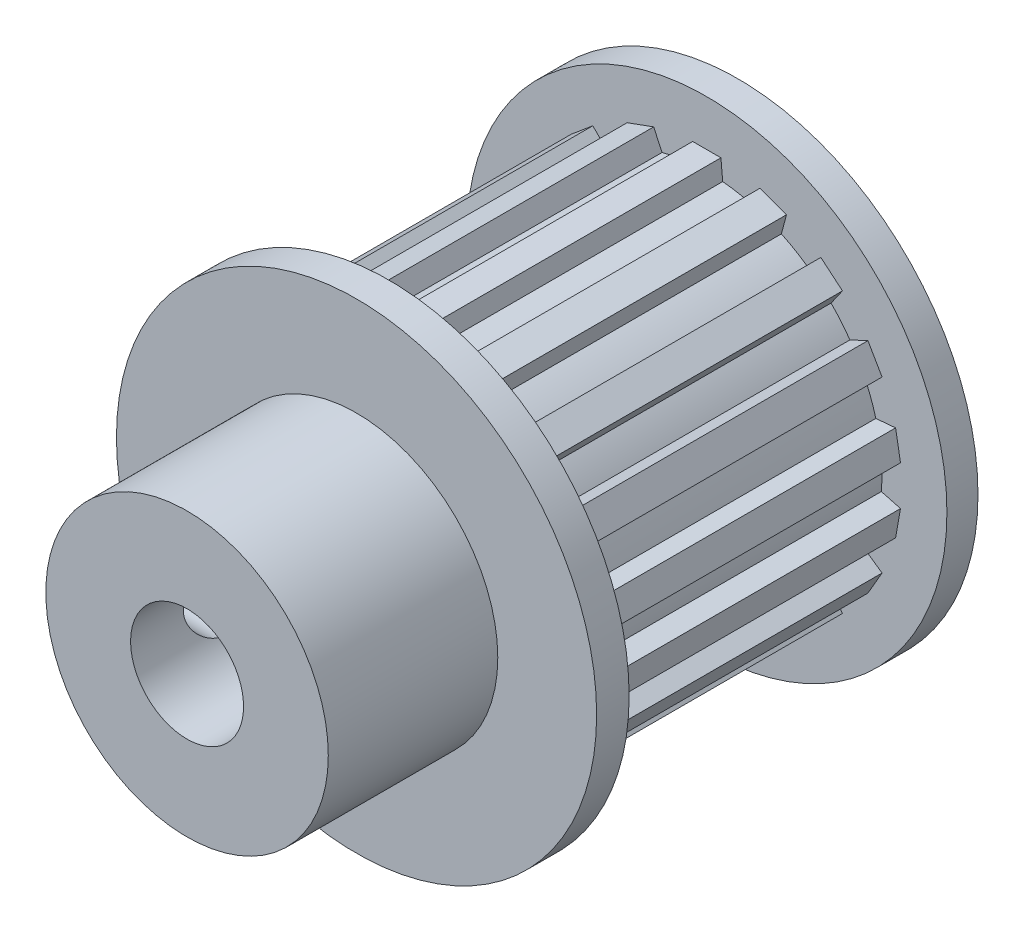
from build123d import *

# Parameters (mm, degrees)
SKETCH6_R                 = 2
CUT_EXTRUDE2_DEPTH        = 24.334523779
SKETCH11_OUTSIDE_W        = 25.254
SKETCH11_OUTSIDE_H        = 25.254
SKETCH11_OUTSIDE_R        = 5
CUT_EXTRUDE3_DEPTH        = 6
F_4_40_TAPPED_HOLE1_D     = 2.2606
F_4_40_TAPPED_HOLE1_DEPTH = 8.5
SKETCH12_OUTSIDE_W        = 25.254
SKETCH12_OUTSIDE_H        = 25.254
SKETCH12_OUTSIDE_R        = 5
CUT_EXTRUDE4_DEPTH        = 0.5
EXTRUDE1_DEPTH            = 11.25
CIRPATTERN1_COUNT         = 18


with BuildPart() as part:
    # Sketch2 → Revolve1 (revolve)
    with BuildSketch(Plane(origin=(0, 0, 0), x_dir=(1, 0, 0), z_dir=(0, 1, 0))):
        Polygon((0, 0), (0, 20), (8.5, 20), (8.5, 18.4), (6.2, 18.4), (6.2, 7.15), (8.5, 7.15), (8.5, 0), align=None)
    revolve(axis=Axis((0, 0, 0), (0, 0, -1)))

    # Sketch6 → Cut-Extrude2 (cut, through all)
    with BuildSketch(Plane(origin=(0, 0, -20), x_dir=(-1, 0, 0), z_dir=(0, 0, -1))):
        Circle(SKETCH6_R)
    extrude(amount=-CUT_EXTRUDE2_DEPTH, mode=Mode.SUBTRACT)

    # Sketch11 outside → Cut-Extrude3 (cut)
    with BuildSketch(Plane.XY):
        Rectangle(SKETCH11_OUTSIDE_W, SKETCH11_OUTSIDE_H)
        Circle(SKETCH11_OUTSIDE_R, mode=Mode.SUBTRACT)
    extrude(amount=-CUT_EXTRUDE3_DEPTH, mode=Mode.SUBTRACT)

    # 4-40 Tapped Hole1
    with Locations(Plane(origin=(-8.5, 0, -3), x_dir=(0, -1, 0), z_dir=(-1, 0, 0))):
        with Locations((0, 0)):
            Hole(F_4_40_TAPPED_HOLE1_D / 2, depth=F_4_40_TAPPED_HOLE1_DEPTH)

    # Sketch12 outside → Cut-Extrude4 (cut)
    with BuildSketch(Plane(origin=(0, 0, -20), x_dir=(-1, 0, 0), z_dir=(0, 0, -1))):
        Rectangle(SKETCH12_OUTSIDE_W, SKETCH12_OUTSIDE_H)
        with Locations(Location((0, 0, 0), (0, 0, 180))):
            Circle(SKETCH12_OUTSIDE_R, mode=Mode.SUBTRACT)
    extrude(amount=-CUT_EXTRUDE4_DEPTH, mode=Mode.SUBTRACT)

    # Sketch5 → Extrude1 (add)
    with BuildSketch(Plane.XY.offset(-7.15)):
        with BuildLine():
            Line((-0.561242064, 6.174545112), (-0.5, 6.874545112))
            Line((-0.5, 6.874545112), (0.5, 6.874545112))
            Line((0.5, 6.874545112), (0.561242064, 6.174545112))
            ThreePointArc((0.561242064, 6.174545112), (0, 6.2), (-0.561242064, 6.174545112))
        make_face()
    extrude1 = extrude(amount=-EXTRUDE1_DEPTH)

    # CirPattern1: Extrude1 ×18 about axis
    cirpattern1_axis = Axis((0, 0, 0), (0, 0, 1))
    for i in range(1, CIRPATTERN1_COUNT):
        add(extrude1.rotate(cirpattern1_axis, i * 360 / CIRPATTERN1_COUNT))


solid = part.part
